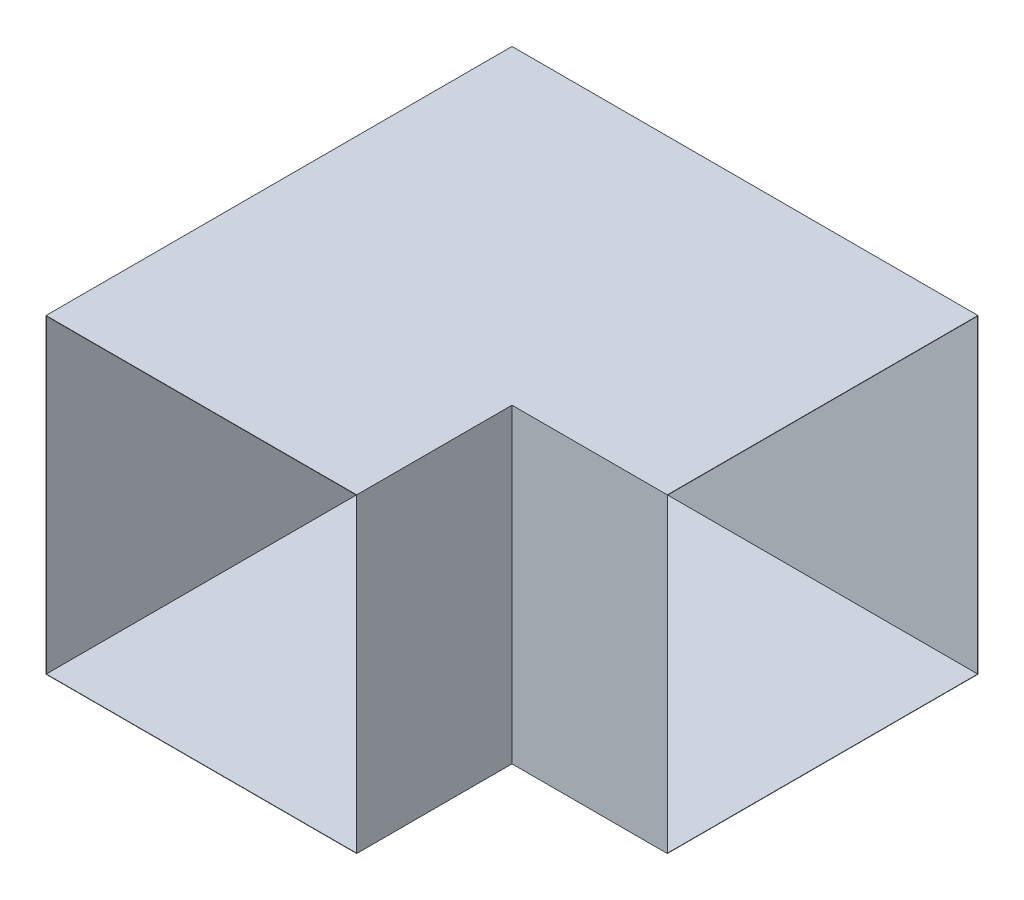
from build123d import *

# Parameters (mm, degrees)
EXTRUDE_THIN1_DEPTH      = 2000
EXTRUDE_THIN1_DEPTH_BACK = 1000
SKETCH1_W                = 2000
SKETCH1_H                = 2000
SKETCH1_W_2              = 1996
SKETCH1_H_2              = 1996
EXTRUDE_THIN2_START      = -1998
SKETCH2_W                = 2000
SKETCH2_H                = 2000
SKETCH2_W_2              = 1996
SKETCH2_H_2              = 1996
EXTRUDE_THIN2_DEPTH      = 2998
CUT_EXTRUDE1_REACH       = 3743.657
SKETCH3_W                = 1996
SKETCH3_H                = 1996
CUT_EXTRUDE2_REACH       = 3743.657
SKETCH4_W                = 1996
SKETCH4_H                = 1996


with BuildPart() as part:
    # Sketch1 → Extrude-Thin1 (new, two sides: drawn at the far end of the back side and taken through both)
    with BuildSketch(Plane(origin=(0, 0, 0), x_dir=(0, 0, -1), z_dir=(1, 0, 0)).offset(-EXTRUDE_THIN1_DEPTH_BACK)):
        Rectangle(SKETCH1_W, SKETCH1_H)
        Rectangle(SKETCH1_W_2, SKETCH1_H_2, mode=Mode.SUBTRACT)
    extrude(amount=EXTRUDE_THIN1_DEPTH + EXTRUDE_THIN1_DEPTH_BACK)

    # Sketch2 → Extrude-Thin2 (add)
    with BuildSketch(Plane(origin=(0, 0, 1000), x_dir=(-1, 0, 0), z_dir=(0, 0, 1)).offset(EXTRUDE_THIN2_START)):
        Rectangle(SKETCH2_W, SKETCH2_H)
        Rectangle(SKETCH2_W_2, SKETCH2_H_2, mode=Mode.SUBTRACT)
    extrude(amount=EXTRUDE_THIN2_DEPTH)

    # Sketch3 → Cut-Extrude1 (cut, up to next)
    with BuildSketch(Plane(origin=(0, 0, 2000), x_dir=(-1, 0, 0), z_dir=(0, 0, 1)), mode=Mode.PRIVATE) as cut_extrude1_sk1:
        Rectangle(SKETCH3_W, SKETCH3_H)
    cut_extrude1_tool1 = extrude(cut_extrude1_sk1.sketch, amount=-CUT_EXTRUDE1_REACH, mode=Mode.PRIVATE) & part.part
    add(cut_extrude1_tool1.solids().sort_by_distance((0, 0, 2000))[0], mode=Mode.SUBTRACT)

    # Sketch4 → Cut-Extrude2 (cut, up to next)
    with BuildSketch(Plane(origin=(2000, 0, 0), x_dir=(0, 0, -1), z_dir=(1, 0, 0)), mode=Mode.PRIVATE) as cut_extrude2_sk1:
        Rectangle(SKETCH4_W, SKETCH4_H)
    cut_extrude2_tool1 = extrude(cut_extrude2_sk1.sketch, amount=-CUT_EXTRUDE2_REACH, mode=Mode.PRIVATE) & part.part
    add(cut_extrude2_tool1.solids().sort_by_distance((2000, 0, 0))[0], mode=Mode.SUBTRACT)


solid = part.part
